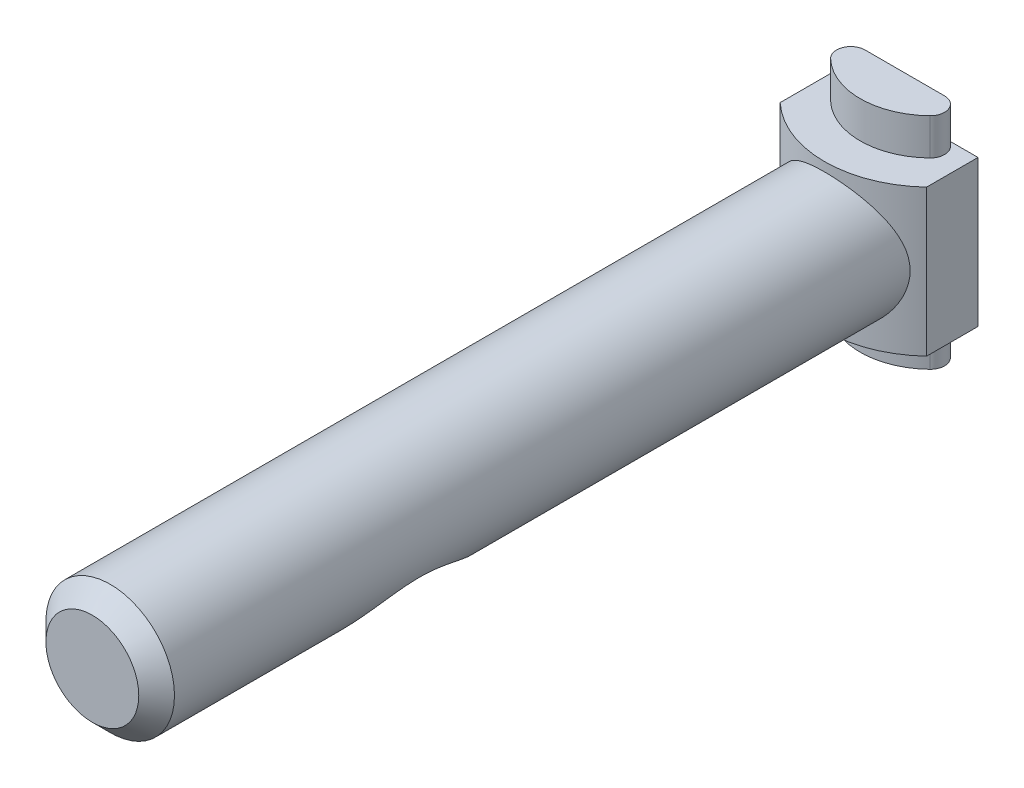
ISO-10303-21;
HEADER;
FILE_DESCRIPTION(('STEP AP214'),'2;1');
FILE_NAME('part.step','',(''),(''),'','','');
FILE_SCHEMA(('AUTOMOTIVE_DESIGN { 1 0 10303 214 1 1 1 1 }'));
ENDSEC;
DATA;
#1=APPLICATION_CONTEXT('core data for automotive mechanical design processes');
#2=APPLICATION_PROTOCOL_DEFINITION('international standard','automotive_design',2000,#1);
#3=PRODUCT_CONTEXT('',#1,'mechanical');
#4=PRODUCT('Part','Part','',(#3));
#5=PRODUCT_RELATED_PRODUCT_CATEGORY('part','',(#4));
#6=PRODUCT_DEFINITION_FORMATION('','',#4);
#7=PRODUCT_DEFINITION_CONTEXT('part definition',#1,'design');
#8=PRODUCT_DEFINITION('design','',#6,#7);
#9=PRODUCT_DEFINITION_SHAPE('','',#8);
#10=(LENGTH_UNIT() NAMED_UNIT(*) SI_UNIT(.MILLI.,.METRE.));
#11=(NAMED_UNIT(*) PLANE_ANGLE_UNIT() SI_UNIT($,.RADIAN.));
#12=(NAMED_UNIT(*) SI_UNIT($,.STERADIAN.) SOLID_ANGLE_UNIT());
#13=UNCERTAINTY_MEASURE_WITH_UNIT(LENGTH_MEASURE(1.E-05),#10,'distance_accuracy_value','');
#14=(GEOMETRIC_REPRESENTATION_CONTEXT(3) GLOBAL_UNCERTAINTY_ASSIGNED_CONTEXT((#13)) GLOBAL_UNIT_ASSIGNED_CONTEXT((#10,
#11,#12)) REPRESENTATION_CONTEXT('',''));
#15=CARTESIAN_POINT('',(0.,0.,0.));
#16=DIRECTION('',(0.,0.,1.));
#17=DIRECTION('',(1.,0.,0.));
#18=AXIS2_PLACEMENT_3D('',#15,#16,#17);
#19=CARTESIAN_POINT('',(1.7460457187E-05,6.14996560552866,-1.50009999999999));
#20=DIRECTION('',(0.,-1.,0.));
#21=DIRECTION('',(0.,0.,-1.));
#22=AXIS2_PLACEMENT_3D('',#19,#20,#21);
#23=PLANE('',#22);
#24=DIRECTION('',(1.,0.,0.));
#25=VECTOR('',#24,1.);
#26=CARTESIAN_POINT('',(1.7460457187E-05,6.14996560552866,1.1643711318E-05));
#27=LINE('',#26,#25);
#28=CARTESIAN_POINT('',(2.22476158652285,6.14996560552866,1.16437113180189E-05));
#29=VERTEX_POINT('',#28);
#30=CARTESIAN_POINT('',(-2.22472666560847,6.14996560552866,1.16437113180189E-05));
#31=VERTEX_POINT('',#30);
#32=EDGE_CURVE('E129',#29,#31,#27,.F.);
#33=ORIENTED_EDGE('',*,*,#32,.T.);
#34=CARTESIAN_POINT('',(-2.22472666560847,6.14996560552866,0.800011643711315));
#35=DIRECTION('',(0.,1.,0.));
#36=DIRECTION('',(0.,0.,1.));
#37=AXIS2_PLACEMENT_3D('',#34,#35,#36);
#38=CIRCLE('',#37,0.8);
#39=CARTESIAN_POINT('',(-2.78091269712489,6.14996560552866,1.37503955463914));
#40=VERTEX_POINT('',#39);
#41=EDGE_CURVE('E224',#40,#31,#38,.F.);
#42=ORIENTED_EDGE('',*,*,#41,.F.);
#43=CARTESIAN_POINT('',(1.7460457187E-05,6.14996560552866,-1.50009999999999));
#44=DIRECTION('',(0.,-1.,0.));
#45=DIRECTION('',(0.,0.,-1.));
#46=AXIS2_PLACEMENT_3D('',#43,#44,#45);
#47=CIRCLE('',#46,4.);
#48=CARTESIAN_POINT('',(2.78094761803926,6.14996560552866,1.37503955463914));
#49=VERTEX_POINT('',#48);
#50=EDGE_CURVE('E236',#49,#40,#47,.T.);
#51=ORIENTED_EDGE('',*,*,#50,.F.);
#52=CARTESIAN_POINT('',(2.22476158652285,6.14996560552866,0.800011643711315));
#53=DIRECTION('',(0.,1.,0.));
#54=DIRECTION('',(0.,0.,1.));
#55=AXIS2_PLACEMENT_3D('',#52,#53,#54);
#56=CIRCLE('',#55,0.8);
#57=EDGE_CURVE('E227',#29,#49,#56,.F.);
#58=ORIENTED_EDGE('',*,*,#57,.F.);
#59=EDGE_LOOP('',(#33,#42,#51,#58));
#60=FACE_BOUND('',#59,.T.);
#61=ADVANCED_FACE('F18',(#60),#23,.F.);
#62=CARTESIAN_POINT('',(1.7460457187E-05,-6.15003439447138,-1.50009999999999));
#63=DIRECTION('',(0.,-1.,0.));
#64=DIRECTION('',(0.,0.,-1.));
#65=AXIS2_PLACEMENT_3D('',#62,#63,#64);
#66=PLANE('',#65);
#67=CARTESIAN_POINT('',(-2.22472666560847,-6.15003439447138,0.800011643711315));
#68=DIRECTION('',(0.,-1.,0.));
#69=DIRECTION('',(0.,0.,-1.));
#70=AXIS2_PLACEMENT_3D('',#67,#68,#69);
#71=CIRCLE('',#70,0.8);
#72=CARTESIAN_POINT('',(-2.22472666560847,-6.15003439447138,1.16437113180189E-05));
#73=VERTEX_POINT('',#72);
#74=CARTESIAN_POINT('',(-2.78091269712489,-6.15003439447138,1.37503955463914));
#75=VERTEX_POINT('',#74);
#76=EDGE_CURVE('E21',#73,#75,#71,.F.);
#77=ORIENTED_EDGE('',*,*,#76,.F.);
#78=DIRECTION('',(1.,0.,0.));
#79=VECTOR('',#78,1.);
#80=CARTESIAN_POINT('',(1.7460457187E-05,-6.15003439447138,1.1643711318E-05));
#81=LINE('',#80,#79);
#82=CARTESIAN_POINT('',(2.22476158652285,-6.15003439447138,1.16437113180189E-05));
#83=VERTEX_POINT('',#82);
#84=EDGE_CURVE('E98',#73,#83,#81,.T.);
#85=ORIENTED_EDGE('',*,*,#84,.T.);
#86=CARTESIAN_POINT('',(2.22476158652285,-6.15003439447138,0.800011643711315));
#87=DIRECTION('',(0.,-1.,0.));
#88=DIRECTION('',(0.,0.,-1.));
#89=AXIS2_PLACEMENT_3D('',#86,#87,#88);
#90=CIRCLE('',#89,0.8);
#91=CARTESIAN_POINT('',(2.78094761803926,-6.15003439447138,1.37503955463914));
#92=VERTEX_POINT('',#91);
#93=EDGE_CURVE('E262',#92,#83,#90,.F.);
#94=ORIENTED_EDGE('',*,*,#93,.F.);
#95=CARTESIAN_POINT('',(1.7460457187E-05,-6.15003439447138,-1.50009999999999));
#96=DIRECTION('',(0.,-1.,0.));
#97=DIRECTION('',(0.,0.,-1.));
#98=AXIS2_PLACEMENT_3D('',#95,#96,#97);
#99=CIRCLE('',#98,4.);
#100=EDGE_CURVE('E101',#75,#92,#99,.F.);
#101=ORIENTED_EDGE('',*,*,#100,.F.);
#102=EDGE_LOOP('',(#77,#85,#94,#101));
#103=FACE_BOUND('',#102,.T.);
#104=ADVANCED_FACE('F96',(#103),#66,.T.);
#105=CARTESIAN_POINT('',(-2.22472666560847,-6.15003439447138,0.800011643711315));
#106=DIRECTION('',(0.,-1.,0.));
#107=DIRECTION('',(0.,0.,-1.));
#108=AXIS2_PLACEMENT_3D('',#105,#106,#107);
#109=CYLINDRICAL_SURFACE('',#108,0.8);
#110=CARTESIAN_POINT('',(-2.22472666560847,-4.1000343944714,0.800011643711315));
#111=DIRECTION('',(0.,-1.,0.));
#112=DIRECTION('',(0.,0.,-1.));
#113=AXIS2_PLACEMENT_3D('',#110,#111,#112);
#114=CIRCLE('',#113,0.8);
#115=CARTESIAN_POINT('',(-2.22472666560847,-4.1000343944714,1.16437112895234E-05));
#116=VERTEX_POINT('',#115);
#117=CARTESIAN_POINT('',(-2.78091269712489,-4.1000343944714,1.37503955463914));
#118=VERTEX_POINT('',#117);
#119=EDGE_CURVE('E110',#116,#118,#114,.F.);
#120=ORIENTED_EDGE('',*,*,#119,.F.);
#121=DIRECTION('',(0.,1.,0.));
#122=VECTOR('',#121,1.);
#123=CARTESIAN_POINT('',(-2.22472666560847,-3.4394471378E-05,1.1643711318E-05));
#124=LINE('',#123,#122);
#125=EDGE_CURVE('E107',#116,#73,#124,.F.);
#126=ORIENTED_EDGE('',*,*,#125,.T.);
#127=ORIENTED_EDGE('',*,*,#76,.T.);
#128=DIRECTION('',(0.,-1.,0.));
#129=VECTOR('',#128,1.);
#130=CARTESIAN_POINT('',(-2.78091269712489,-6.15003439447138,1.37503955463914));
#131=LINE('',#130,#129);
#132=EDGE_CURVE('E105',#118,#75,#131,.T.);
#133=ORIENTED_EDGE('',*,*,#132,.F.);
#134=EDGE_LOOP('',(#120,#126,#127,#133));
#135=FACE_BOUND('',#134,.T.);
#136=ADVANCED_FACE('F108',(#135),#109,.T.);
#137=CARTESIAN_POINT('',(1.7460457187E-05,-6.15003439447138,-1.50009999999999));
#138=DIRECTION('',(0.,-1.,0.));
#139=DIRECTION('',(0.,0.,-1.));
#140=AXIS2_PLACEMENT_3D('',#137,#138,#139);
#141=CYLINDRICAL_SURFACE('',#140,4.);
#142=ORIENTED_EDGE('',*,*,#132,.T.);
#143=ORIENTED_EDGE('',*,*,#100,.T.);
#144=DIRECTION('',(0.,-1.,0.));
#145=VECTOR('',#144,1.);
#146=CARTESIAN_POINT('',(2.78094761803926,-6.15003439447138,1.37503955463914));
#147=LINE('',#146,#145);
#148=CARTESIAN_POINT('',(2.78094761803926,-4.1000343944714,1.37503955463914));
#149=VERTEX_POINT('',#148);
#150=EDGE_CURVE('E237',#149,#92,#147,.T.);
#151=ORIENTED_EDGE('',*,*,#150,.F.);
#152=CARTESIAN_POINT('',(1.7460457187E-05,-4.1000343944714,-1.50009999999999));
#153=DIRECTION('',(0.,-1.,0.));
#154=DIRECTION('',(0.,0.,-1.));
#155=AXIS2_PLACEMENT_3D('',#152,#153,#154);
#156=CIRCLE('',#155,4.);
#157=EDGE_CURVE('E272',#118,#149,#156,.F.);
#158=ORIENTED_EDGE('',*,*,#157,.F.);
#159=EDGE_LOOP('',(#142,#143,#151,#158));
#160=FACE_BOUND('',#159,.T.);
#161=ADVANCED_FACE('F208',(#160),#141,.T.);
#162=CARTESIAN_POINT('',(2.22476158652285,-6.15003439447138,0.800011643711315));
#163=DIRECTION('',(0.,-1.,0.));
#164=DIRECTION('',(0.,0.,-1.));
#165=AXIS2_PLACEMENT_3D('',#162,#163,#164);
#166=CYLINDRICAL_SURFACE('',#165,0.8);
#167=CARTESIAN_POINT('',(2.22476158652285,-4.1000343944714,0.800011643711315));
#168=DIRECTION('',(0.,-1.,0.));
#169=DIRECTION('',(0.,0.,-1.));
#170=AXIS2_PLACEMENT_3D('',#167,#168,#169);
#171=CIRCLE('',#170,0.8);
#172=CARTESIAN_POINT('',(2.22476158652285,-4.1000343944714,1.16437113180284E-05));
#173=VERTEX_POINT('',#172);
#174=EDGE_CURVE('E277',#149,#173,#171,.F.);
#175=ORIENTED_EDGE('',*,*,#174,.F.);
#176=ORIENTED_EDGE('',*,*,#150,.T.);
#177=ORIENTED_EDGE('',*,*,#93,.T.);
#178=DIRECTION('',(0.,1.,0.));
#179=VECTOR('',#178,1.);
#180=CARTESIAN_POINT('',(2.22476158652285,-3.4394471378E-05,1.1643711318E-05));
#181=LINE('',#180,#179);
#182=EDGE_CURVE('E121',#83,#173,#181,.T.);
#183=ORIENTED_EDGE('',*,*,#182,.T.);
#184=EDGE_LOOP('',(#175,#176,#177,#183));
#185=FACE_BOUND('',#184,.T.);
#186=ADVANCED_FACE('F204',(#185),#166,.T.);
#187=CARTESIAN_POINT('',(-2.22472666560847,-6.15003439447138,0.800011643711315));
#188=DIRECTION('',(0.,1.,0.));
#189=DIRECTION('',(0.,0.,1.));
#190=AXIS2_PLACEMENT_3D('',#187,#188,#189);
#191=CYLINDRICAL_SURFACE('',#190,0.8);
#192=CARTESIAN_POINT('',(-2.22472666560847,4.09996560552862,0.800011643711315));
#193=DIRECTION('',(0.,1.,0.));
#194=DIRECTION('',(0.,0.,1.));
#195=AXIS2_PLACEMENT_3D('',#192,#193,#194);
#196=CIRCLE('',#195,0.8);
#197=CARTESIAN_POINT('',(-2.22472666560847,4.09996560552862,1.16437112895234E-05));
#198=VERTEX_POINT('',#197);
#199=CARTESIAN_POINT('',(-2.78091269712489,4.09996560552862,1.37503955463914));
#200=VERTEX_POINT('',#199);
#201=EDGE_CURVE('E254',#198,#200,#196,.T.);
#202=ORIENTED_EDGE('',*,*,#201,.T.);
#203=DIRECTION('',(0.,-1.,0.));
#204=VECTOR('',#203,1.);
#205=CARTESIAN_POINT('',(-2.78091269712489,-6.15003439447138,1.37503955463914));
#206=LINE('',#205,#204);
#207=EDGE_CURVE('E234',#40,#200,#206,.T.);
#208=ORIENTED_EDGE('',*,*,#207,.F.);
#209=ORIENTED_EDGE('',*,*,#41,.T.);
#210=DIRECTION('',(0.,1.,0.));
#211=VECTOR('',#210,1.);
#212=CARTESIAN_POINT('',(-2.22472666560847,-3.4394471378E-05,1.1643711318E-05));
#213=LINE('',#212,#211);
#214=EDGE_CURVE('E115',#31,#198,#213,.F.);
#215=ORIENTED_EDGE('',*,*,#214,.T.);
#216=EDGE_LOOP('',(#202,#208,#209,#215));
#217=FACE_BOUND('',#216,.T.);
#218=ADVANCED_FACE('F200',(#217),#191,.T.);
#219=CARTESIAN_POINT('',(1.7460457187E-05,-6.15003439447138,-1.50009999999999));
#220=DIRECTION('',(0.,-1.,0.));
#221=DIRECTION('',(0.,0.,-1.));
#222=AXIS2_PLACEMENT_3D('',#219,#220,#221);
#223=CYLINDRICAL_SURFACE('',#222,4.);
#224=ORIENTED_EDGE('',*,*,#207,.T.);
#225=CARTESIAN_POINT('',(1.7460457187E-05,4.09996560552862,-1.50009999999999));
#226=DIRECTION('',(0.,-1.,0.));
#227=DIRECTION('',(0.,0.,-1.));
#228=AXIS2_PLACEMENT_3D('',#225,#226,#227);
#229=CIRCLE('',#228,4.);
#230=CARTESIAN_POINT('',(2.78094761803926,4.09996560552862,1.37503955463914));
#231=VERTEX_POINT('',#230);
#232=EDGE_CURVE('E281',#200,#231,#229,.F.);
#233=ORIENTED_EDGE('',*,*,#232,.T.);
#234=DIRECTION('',(0.,1.,0.));
#235=VECTOR('',#234,1.);
#236=CARTESIAN_POINT('',(2.78094761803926,-6.15003439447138,1.37503955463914));
#237=LINE('',#236,#235);
#238=EDGE_CURVE('E231',#49,#231,#237,.F.);
#239=ORIENTED_EDGE('',*,*,#238,.F.);
#240=ORIENTED_EDGE('',*,*,#50,.T.);
#241=EDGE_LOOP('',(#224,#233,#239,#240));
#242=FACE_BOUND('',#241,.T.);
#243=ADVANCED_FACE('F196',(#242),#223,.T.);
#244=CARTESIAN_POINT('',(2.22476158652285,-6.15003439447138,0.800011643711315));
#245=DIRECTION('',(0.,1.,0.));
#246=DIRECTION('',(0.,0.,1.));
#247=AXIS2_PLACEMENT_3D('',#244,#245,#246);
#248=CYLINDRICAL_SURFACE('',#247,0.8);
#249=CARTESIAN_POINT('',(2.22476158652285,4.09996560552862,0.800011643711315));
#250=DIRECTION('',(0.,1.,0.));
#251=DIRECTION('',(0.,0.,1.));
#252=AXIS2_PLACEMENT_3D('',#249,#250,#251);
#253=CIRCLE('',#252,0.8);
#254=CARTESIAN_POINT('',(2.22476158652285,4.09996560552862,1.16437113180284E-05));
#255=VERTEX_POINT('',#254);
#256=EDGE_CURVE('E283',#231,#255,#253,.T.);
#257=ORIENTED_EDGE('',*,*,#256,.T.);
#258=DIRECTION('',(0.,1.,0.));
#259=VECTOR('',#258,1.);
#260=CARTESIAN_POINT('',(2.22476158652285,-3.4394471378E-05,1.1643711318E-05));
#261=LINE('',#260,#259);
#262=EDGE_CURVE('E126',#255,#29,#261,.T.);
#263=ORIENTED_EDGE('',*,*,#262,.T.);
#264=ORIENTED_EDGE('',*,*,#57,.T.);
#265=ORIENTED_EDGE('',*,*,#238,.T.);
#266=EDGE_LOOP('',(#257,#263,#264,#265));
#267=FACE_BOUND('',#266,.T.);
#268=ADVANCED_FACE('F193',(#267),#248,.T.);
#269=CARTESIAN_POINT('',(1.7460457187E-05,-3.4394471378E-05,1.1643711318E-05));
#270=DIRECTION('',(0.,0.,1.));
#271=DIRECTION('',(1.,0.,0.));
#272=AXIS2_PLACEMENT_3D('',#269,#270,#271);
#273=PLANE('',#272);
#274=DIRECTION('',(1.,0.,0.));
#275=VECTOR('',#274,1.);
#276=CARTESIAN_POINT('',(0.100017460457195,4.09996560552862,1.16437113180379E-05));
#277=LINE('',#276,#275);
#278=CARTESIAN_POINT('',(4.10001746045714,4.09996560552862,1.16437113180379E-05));
#279=VERTEX_POINT('',#278);
#280=EDGE_CURVE('E285',#255,#279,#277,.T.);
#281=ORIENTED_EDGE('',*,*,#280,.T.);
#282=DIRECTION('',(0.,1.,0.));
#283=VECTOR('',#282,1.);
#284=CARTESIAN_POINT('',(4.10001746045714,-3.4394471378E-05,1.16437113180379E-05));
#285=LINE('',#284,#283);
#286=CARTESIAN_POINT('',(4.10001746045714,-4.1000343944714,1.16437113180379E-05));
#287=VERTEX_POINT('',#286);
#288=EDGE_CURVE('E251',#279,#287,#285,.F.);
#289=ORIENTED_EDGE('',*,*,#288,.T.);
#290=DIRECTION('',(1.,0.,0.));
#291=VECTOR('',#290,1.);
#292=CARTESIAN_POINT('',(-0.099982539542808,-4.1000343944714,1.16437113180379E-05));
#293=LINE('',#292,#291);
#294=EDGE_CURVE('E246',#173,#287,#293,.T.);
#295=ORIENTED_EDGE('',*,*,#294,.F.);
#296=ORIENTED_EDGE('',*,*,#182,.F.);
#297=ORIENTED_EDGE('',*,*,#84,.F.);
#298=ORIENTED_EDGE('',*,*,#125,.F.);
#299=DIRECTION('',(1.,0.,0.));
#300=VECTOR('',#299,1.);
#301=CARTESIAN_POINT('',(-0.099982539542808,-4.1000343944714,1.16437112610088E-05));
#302=LINE('',#301,#300);
#303=CARTESIAN_POINT('',(-4.09998253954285,-4.1000343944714,1.16437112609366E-05));
#304=VERTEX_POINT('',#303);
#305=EDGE_CURVE('E273',#304,#116,#302,.T.);
#306=ORIENTED_EDGE('',*,*,#305,.F.);
#307=DIRECTION('',(0.,1.,0.));
#308=VECTOR('',#307,1.);
#309=CARTESIAN_POINT('',(-4.09998253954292,-3.4394471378E-05,1.1643711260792E-05));
#310=LINE('',#309,#308);
#311=CARTESIAN_POINT('',(-4.09998253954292,4.09996560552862,1.16437112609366E-05));
#312=VERTEX_POINT('',#311);
#313=EDGE_CURVE('E248',#304,#312,#310,.T.);
#314=ORIENTED_EDGE('',*,*,#313,.T.);
#315=DIRECTION('',(1.,0.,0.));
#316=VECTOR('',#315,1.);
#317=CARTESIAN_POINT('',(0.100017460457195,4.09996560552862,1.16437112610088E-05));
#318=LINE('',#317,#316);
#319=EDGE_CURVE('E241',#312,#198,#318,.T.);
#320=ORIENTED_EDGE('',*,*,#319,.T.);
#321=ORIENTED_EDGE('',*,*,#214,.F.);
#322=ORIENTED_EDGE('',*,*,#32,.F.);
#323=ORIENTED_EDGE('',*,*,#262,.F.);
#324=EDGE_LOOP('',(#281,#289,#295,#296,#297,#298,#306,#314,#320,#321,#322,#323));
#325=FACE_BOUND('',#324,.T.);
#326=ADVANCED_FACE('F119',(#325),#273,.F.);
#327=CARTESIAN_POINT('',(1.7460457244E-05,-3.4394471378E-05,45.4999));
#328=DIRECTION('',(0.,0.,-1.));
#329=DIRECTION('',(-1.,0.,0.));
#330=AXIS2_PLACEMENT_3D('',#327,#328,#329);
#331=PLANE('',#330);
#332=CARTESIAN_POINT('',(1.74604572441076E-05,-3.4394471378E-05,45.4999000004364));
#333=DIRECTION('',(0.,0.,-1.));
#334=DIRECTION('',(-1.,0.,0.));
#335=AXIS2_PLACEMENT_3D('',#332,#333,#334);
#336=CIRCLE('',#335,2.60000000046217);
#337=CARTESIAN_POINT('',(2.60001746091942,-3.43944713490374E-05,45.4999000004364));
#338=VERTEX_POINT('',#337);
#339=EDGE_CURVE('E34',#338,#338,#336,.T.);
#340=ORIENTED_EDGE('',*,*,#339,.F.);
#341=EDGE_LOOP('',(#340));
#342=FACE_BOUND('',#341,.T.);
#343=ADVANCED_FACE('F187',(#342),#331,.F.);
#344=CARTESIAN_POINT('',(-4.09998253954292,-3.4394471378E-05,1.99995582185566));
#345=DIRECTION('',(1.,0.,0.));
#346=DIRECTION('',(0.,0.,-1.));
#347=AXIS2_PLACEMENT_3D('',#344,#345,#346);
#348=PLANE('',#347);
#349=ORIENTED_EDGE('',*,*,#313,.F.);
#350=DIRECTION('',(0.,0.,-1.));
#351=VECTOR('',#350,1.);
#352=CARTESIAN_POINT('',(-4.09998253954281,-4.1000343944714,-1.50009999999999));
#353=LINE('',#352,#351);
#354=CARTESIAN_POINT('',(-4.09998253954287,-4.1000343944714,2.88053922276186));
#355=VERTEX_POINT('',#354);
#356=EDGE_CURVE('E314',#355,#304,#353,.T.);
#357=ORIENTED_EDGE('',*,*,#356,.F.);
#358=DIRECTION('',(0.,-1.,0.));
#359=VECTOR('',#358,1.);
#360=CARTESIAN_POINT('',(-4.09998253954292,-4.1000343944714,2.88053922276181));
#361=LINE('',#360,#359);
#362=CARTESIAN_POINT('',(-4.09998253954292,4.09996560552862,2.88053922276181));
#363=VERTEX_POINT('',#362);
#364=EDGE_CURVE('E288',#363,#355,#361,.T.);
#365=ORIENTED_EDGE('',*,*,#364,.F.);
#366=DIRECTION('',(0.,0.,-1.));
#367=VECTOR('',#366,1.);
#368=CARTESIAN_POINT('',(-4.09998253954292,4.09996560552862,-1.50009999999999));
#369=LINE('',#368,#367);
#370=EDGE_CURVE('E481',#363,#312,#369,.T.);
#371=ORIENTED_EDGE('',*,*,#370,.T.);
#372=EDGE_LOOP('',(#349,#357,#365,#371));
#373=FACE_BOUND('',#372,.T.);
#374=ADVANCED_FACE('F183',(#373),#348,.F.);
#375=CARTESIAN_POINT('',(-0.099982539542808,-4.1000343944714,-1.50009999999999));
#376=DIRECTION('',(0.,-1.,0.));
#377=DIRECTION('',(0.,0.,-1.));
#378=AXIS2_PLACEMENT_3D('',#375,#376,#377);
#379=PLANE('',#378);
#380=ORIENTED_EDGE('',*,*,#157,.T.);
#381=ORIENTED_EDGE('',*,*,#174,.T.);
#382=ORIENTED_EDGE('',*,*,#294,.T.);
#383=DIRECTION('',(0.,0.,1.));
#384=VECTOR('',#383,1.);
#385=CARTESIAN_POINT('',(4.10001746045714,-4.1000343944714,2.49995582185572));
#386=LINE('',#385,#384);
#387=CARTESIAN_POINT('',(4.10001746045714,-4.1000343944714,2.88053922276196));
#388=VERTEX_POINT('',#387);
#389=EDGE_CURVE('E255',#287,#388,#386,.T.);
#390=ORIENTED_EDGE('',*,*,#389,.T.);
#391=CARTESIAN_POINT('',(1.7460457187E-05,-4.1000343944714,-1.50009999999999));
#392=DIRECTION('',(0.,-1.,0.));
#393=DIRECTION('',(0.,0.,-1.));
#394=AXIS2_PLACEMENT_3D('',#391,#392,#393);
#395=CIRCLE('',#394,6.);
#396=EDGE_CURVE('E289',#355,#388,#395,.F.);
#397=ORIENTED_EDGE('',*,*,#396,.F.);
#398=ORIENTED_EDGE('',*,*,#356,.T.);
#399=ORIENTED_EDGE('',*,*,#305,.T.);
#400=ORIENTED_EDGE('',*,*,#119,.T.);
#401=EDGE_LOOP('',(#380,#381,#382,#390,#397,#398,#399,#400));
#402=FACE_BOUND('',#401,.T.);
#403=ADVANCED_FACE('F179',(#402),#379,.T.);
#404=CARTESIAN_POINT('',(4.10001746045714,-3.4394471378E-05,2.49995582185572));
#405=DIRECTION('',(-1.,0.,0.));
#406=DIRECTION('',(0.,0.,1.));
#407=AXIS2_PLACEMENT_3D('',#404,#405,#406);
#408=PLANE('',#407);
#409=DIRECTION('',(0.,0.,-1.));
#410=VECTOR('',#409,1.);
#411=CARTESIAN_POINT('',(4.10001746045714,4.09996560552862,-1.50009999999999));
#412=LINE('',#411,#410);
#413=CARTESIAN_POINT('',(4.10001746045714,4.09996560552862,2.88053922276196));
#414=VERTEX_POINT('',#413);
#415=EDGE_CURVE('E327',#279,#414,#412,.F.);
#416=ORIENTED_EDGE('',*,*,#415,.T.);
#417=DIRECTION('',(0.,-1.,0.));
#418=VECTOR('',#417,1.);
#419=CARTESIAN_POINT('',(4.10001746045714,-4.1000343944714,2.88053922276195));
#420=LINE('',#419,#418);
#421=EDGE_CURVE('E291',#388,#414,#420,.F.);
#422=ORIENTED_EDGE('',*,*,#421,.F.);
#423=ORIENTED_EDGE('',*,*,#389,.F.);
#424=ORIENTED_EDGE('',*,*,#288,.F.);
#425=EDGE_LOOP('',(#416,#422,#423,#424));
#426=FACE_BOUND('',#425,.T.);
#427=ADVANCED_FACE('F175',(#426),#408,.F.);
#428=CARTESIAN_POINT('',(0.100017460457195,4.09996560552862,-1.50009999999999));
#429=DIRECTION('',(0.,-1.,0.));
#430=DIRECTION('',(0.,0.,-1.));
#431=AXIS2_PLACEMENT_3D('',#428,#429,#430);
#432=PLANE('',#431);
#433=ORIENTED_EDGE('',*,*,#370,.F.);
#434=CARTESIAN_POINT('',(1.7460457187E-05,4.09996560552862,-1.50009999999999));
#435=DIRECTION('',(0.,-1.,0.));
#436=DIRECTION('',(0.,0.,-1.));
#437=AXIS2_PLACEMENT_3D('',#434,#435,#436);
#438=CIRCLE('',#437,6.);
#439=EDGE_CURVE('E292',#414,#363,#438,.T.);
#440=ORIENTED_EDGE('',*,*,#439,.F.);
#441=ORIENTED_EDGE('',*,*,#415,.F.);
#442=ORIENTED_EDGE('',*,*,#280,.F.);
#443=ORIENTED_EDGE('',*,*,#256,.F.);
#444=ORIENTED_EDGE('',*,*,#232,.F.);
#445=ORIENTED_EDGE('',*,*,#201,.F.);
#446=ORIENTED_EDGE('',*,*,#319,.F.);
#447=EDGE_LOOP('',(#433,#440,#441,#442,#443,#444,#445,#446));
#448=FACE_BOUND('',#447,.T.);
#449=ADVANCED_FACE('F171',(#448),#432,.F.);
#450=CARTESIAN_POINT('',(1.74604572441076E-05,-3.4394471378E-05,44.4998999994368));
#451=DIRECTION('',(0.,0.,-1.));
#452=DIRECTION('',(-1.,0.,0.));
#453=AXIS2_PLACEMENT_3D('',#450,#451,#452);
#454=CONICAL_SURFACE('',#453,3.59999999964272,0.785398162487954);
#455=ORIENTED_EDGE('',*,*,#339,.T.);
#456=EDGE_LOOP('',(#455));
#457=FACE_BOUND('',#456,.T.);
#458=CARTESIAN_POINT('',(1.7460457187E-05,-3.4394471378E-05,44.4999));
#459=DIRECTION('',(0.,0.,-1.));
#460=DIRECTION('',(-1.,0.,0.));
#461=AXIS2_PLACEMENT_3D('',#458,#459,#460);
#462=CIRCLE('',#461,3.6);
#463=CARTESIAN_POINT('',(3.60001746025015,-3.43944713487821E-05,44.4998999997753));
#464=VERTEX_POINT('',#463);
#465=EDGE_CURVE('E294',#464,#464,#462,.T.);
#466=ORIENTED_EDGE('',*,*,#465,.F.);
#467=EDGE_LOOP('',(#466));
#468=FACE_BOUND('',#467,.T.);
#469=ADVANCED_FACE('F166',(#457,#468),#454,.T.);
#470=CARTESIAN_POINT('',(1.7460457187E-05,-4.1000343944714,-1.50009999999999));
#471=DIRECTION('',(0.,-1.,0.));
#472=DIRECTION('',(0.,0.,-1.));
#473=AXIS2_PLACEMENT_3D('',#470,#471,#472);
#474=CYLINDRICAL_SURFACE('',#473,6.);
#475=CARTESIAN_POINT('',(-3.59998253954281,-3.43944713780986E-05,3.29990000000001));
#476=CARTESIAN_POINT('',(-3.60000286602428,-0.091080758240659,3.29986144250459));
#477=CARTESIAN_POINT('',(-3.59652944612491,-0.182104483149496,3.30248943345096));
#478=CARTESIAN_POINT('',(-3.5827567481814,-0.363260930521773,3.31278498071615));
#479=CARTESIAN_POINT('',(-3.57246412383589,-0.453394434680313,3.32044762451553));
#480=CARTESIAN_POINT('',(-3.54532311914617,-0.631389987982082,3.34043968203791));
#481=CARTESIAN_POINT('',(-3.5285278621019,-0.719264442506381,3.35273125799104));
#482=CARTESIAN_POINT('',(-3.48864812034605,-0.892868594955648,3.38147941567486));
#483=CARTESIAN_POINT('',(-3.46556237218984,-0.978597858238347,3.39793683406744));
#484=CARTESIAN_POINT('',(-3.38750069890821,-1.23114978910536,3.4525512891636));
#485=CARTESIAN_POINT('',(-3.32359313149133,-1.39414647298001,3.49605056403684));
#486=CARTESIAN_POINT('',(-3.17421474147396,-1.70721874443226,3.59225967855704));
#487=CARTESIAN_POINT('',(-3.08869497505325,-1.85726395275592,3.64499033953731));
#488=CARTESIAN_POINT('',(-2.88648098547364,-2.15992914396,3.76139568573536));
#489=CARTESIAN_POINT('',(-2.76726281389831,-2.31065113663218,3.82562187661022));
#490=CARTESIAN_POINT('',(-2.50614275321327,-2.59154223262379,3.9533629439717));
#491=CARTESIAN_POINT('',(-2.36423274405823,-2.72170394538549,4.01687755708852));
#492=CARTESIAN_POINT('',(-2.12773740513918,-2.9059087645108,4.11068715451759));
#493=CARTESIAN_POINT('',(-2.04021183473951,-2.96804056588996,4.14318222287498));
#494=CARTESIAN_POINT('',(-1.85926013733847,-3.0846182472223,4.20535541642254));
#495=CARTESIAN_POINT('',(-1.76583666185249,-3.13906754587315,4.23503479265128));
#496=CARTESIAN_POINT('',(-1.57363502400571,-3.23969198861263,4.29072267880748));
#497=CARTESIAN_POINT('',(-1.47485888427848,-3.28587023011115,4.31673256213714));
#498=CARTESIAN_POINT('',(-1.27259990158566,-3.36936785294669,4.36430360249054));
#499=CARTESIAN_POINT('',(-1.16911783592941,-3.4066886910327,4.38586549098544));
#500=CARTESIAN_POINT('',(-0.968365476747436,-3.4687801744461,4.42203001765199));
#501=CARTESIAN_POINT('',(-0.871444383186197,-3.49440844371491,4.43710032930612));
#502=CARTESIAN_POINT('',(-0.675222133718,-3.53756724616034,4.46260364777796));
#503=CARTESIAN_POINT('',(-0.575921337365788,-3.5550989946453,4.47303735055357));
#504=CARTESIAN_POINT('',(-0.375879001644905,-3.58177647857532,4.48895348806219));
#505=CARTESIAN_POINT('',(-0.275138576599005,-3.59092837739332,4.49443956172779));
#506=CARTESIAN_POINT('',(-0.0731019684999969,-3.60071215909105,4.50030538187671));
#507=CARTESIAN_POINT('',(0.0281941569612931,-3.60134490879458,4.50068564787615));
#508=CARTESIAN_POINT('',(0.217787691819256,-3.59453297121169,4.49660026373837));
#509=CARTESIAN_POINT('',(0.306135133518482,-3.58808294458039,4.49273133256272));
#510=CARTESIAN_POINT('',(0.481877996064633,-3.56873722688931,4.48116948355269));
#511=CARTESIAN_POINT('',(0.569273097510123,-3.55583943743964,4.47347532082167));
#512=CARTESIAN_POINT('',(0.829033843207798,-3.50769147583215,4.44489387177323));
#513=CARTESIAN_POINT('',(0.999154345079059,-3.46297987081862,4.41850326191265));
#514=CARTESIAN_POINT('',(1.32978280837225,-3.35003367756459,4.35313671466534));
#515=CARTESIAN_POINT('',(1.49022906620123,-3.28166370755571,4.31408842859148));
#516=CARTESIAN_POINT('',(1.79758702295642,-3.12391013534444,4.22653021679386));
#517=CARTESIAN_POINT('',(1.94449558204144,-3.03452167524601,4.17801810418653));
#518=CARTESIAN_POINT('',(2.23937924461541,-2.8252313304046,4.06881687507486));
#519=CARTESIAN_POINT('',(2.38539008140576,-2.70296124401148,4.00736547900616));
#520=CARTESIAN_POINT('',(2.65609571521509,-2.4375134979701,3.88205220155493));
#521=CARTESIAN_POINT('',(2.78075561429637,-2.29430230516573,3.81818657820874));
#522=CARTESIAN_POINT('',(3.01993737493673,-1.97107281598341,3.68649722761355));
#523=CARTESIAN_POINT('',(3.13157945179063,-1.78870959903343,3.61908107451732));
#524=CARTESIAN_POINT('',(3.27426046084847,-1.50030901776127,3.52807380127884));
#525=CARTESIAN_POINT('',(3.31766042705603,-1.40180189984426,3.49944700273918));
#526=CARTESIAN_POINT('',(3.3957661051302,-1.20026095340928,3.44672786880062));
#527=CARTESIAN_POINT('',(3.43047894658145,-1.09723091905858,3.42263181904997));
#528=CARTESIAN_POINT('',(3.48330580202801,-0.91300448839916,3.38533535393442));
#529=CARTESIAN_POINT('',(3.5034032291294,-0.832617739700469,3.37091107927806));
#530=CARTESIAN_POINT('',(3.53808235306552,-0.670106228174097,3.34578001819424));
#531=CARTESIAN_POINT('',(3.55266586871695,-0.587982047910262,3.33507200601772));
#532=CARTESIAN_POINT('',(3.57619961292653,-0.421925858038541,3.31769515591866));
#533=CARTESIAN_POINT('',(3.58511083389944,-0.337985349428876,3.31105429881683));
#534=CARTESIAN_POINT('',(3.59703032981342,-0.169380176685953,3.30213999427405));
#535=CARTESIAN_POINT('',(3.60003315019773,-0.0847149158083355,3.29987058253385));
#536=CARTESIAN_POINT('',(3.60001746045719,-3.43944713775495E-05,3.29990000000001));
#537=B_SPLINE_CURVE_WITH_KNOTS('',3,(#475,#476,#477,#478,#479,#480,#481,#482,#483,#484,#485,
#486,#487,#488,#489,#490,#491,#492,#493,#494,#495,#496,#497,#498,#499,#500,#501,#502,#503,#504,
#505,#506,#507,#508,#509,#510,#511,#512,#513,#514,#515,#516,#517,#518,#519,#520,#521,#522,#523,
#524,#525,#526,#527,#528,#529,#530,#531,#532,#533,#534,#535,#536),.UNSPECIFIED.,.F.,.F.,(4,2,2,
2,2,2,2,2,2,2,2,2,2,2,2,2,2,2,2,2,2,2,2,2,2,2,2,2,2,2,4),(0.,0.27299826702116,0.545730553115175,
0.816280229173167,1.08688428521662,1.62564619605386,2.16563931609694,2.77117496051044,
3.37692777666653,3.71298632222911,4.0488948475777,4.38467731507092,4.72040451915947,
5.02410344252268,5.32775676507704,5.63118657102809,5.93458550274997,6.20025618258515,
6.46601337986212,6.99699588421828,7.53106853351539,8.06526474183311,8.6632004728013,
9.26210438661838,9.93088430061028,10.2646296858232,10.598100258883,10.8501681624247,
11.1021528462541,11.3558521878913,11.6097856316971),.UNSPECIFIED.);
#538=CARTESIAN_POINT('',(-3.59998253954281,-3.43944713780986E-05,3.29990000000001));
#539=VERTEX_POINT('',#538);
#540=CARTESIAN_POINT('',(3.60001746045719,-3.43944713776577E-05,3.29990000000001));
#541=VERTEX_POINT('',#540);
#542=EDGE_CURVE('E151',#539,#541,#537,.T.);
#543=ORIENTED_EDGE('',*,*,#542,.F.);
#544=CARTESIAN_POINT('',(3.60001746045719,-3.43944713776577E-05,3.29990000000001));
#545=CARTESIAN_POINT('',(3.60003778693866,0.0910119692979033,3.29986144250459));
#546=CARTESIAN_POINT('',(3.59656436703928,0.18203569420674,3.30248943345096));
#547=CARTESIAN_POINT('',(3.58279166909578,0.363192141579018,3.31278498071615));
#548=CARTESIAN_POINT('',(3.57249904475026,0.453325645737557,3.32044762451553));
#549=CARTESIAN_POINT('',(3.54535804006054,0.631321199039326,3.34043968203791));
#550=CARTESIAN_POINT('',(3.52856278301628,0.719195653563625,3.35273125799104));
#551=CARTESIAN_POINT('',(3.48868304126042,0.892799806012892,3.38147941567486));
#552=CARTESIAN_POINT('',(3.46559729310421,0.978529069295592,3.39793683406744));
#553=CARTESIAN_POINT('',(3.38753561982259,1.23108100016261,3.4525512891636));
#554=CARTESIAN_POINT('',(3.3236280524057,1.39407768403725,3.49605056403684));
#555=CARTESIAN_POINT('',(3.17424966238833,1.7071499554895,3.59225967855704));
#556=CARTESIAN_POINT('',(3.08872989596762,1.85719516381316,3.64499033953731));
#557=CARTESIAN_POINT('',(2.88651590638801,2.15986035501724,3.76139568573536));
#558=CARTESIAN_POINT('',(2.76729773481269,2.31058234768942,3.82562187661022));
#559=CARTESIAN_POINT('',(2.50617767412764,2.59147344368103,3.9533629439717));
#560=CARTESIAN_POINT('',(2.3642676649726,2.72163515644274,4.01687755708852));
#561=CARTESIAN_POINT('',(2.12777232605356,2.90583997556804,4.11068715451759));
#562=CARTESIAN_POINT('',(2.04024675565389,2.9679717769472,4.14318222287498));
#563=CARTESIAN_POINT('',(1.85929505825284,3.08454945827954,4.20535541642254));
#564=CARTESIAN_POINT('',(1.76587158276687,3.13899875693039,4.23503479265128));
#565=CARTESIAN_POINT('',(1.57366994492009,3.23962319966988,4.29072267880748));
#566=CARTESIAN_POINT('',(1.47489380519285,3.28580144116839,4.31673256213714));
#567=CARTESIAN_POINT('',(1.27263482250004,3.36929906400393,4.36430360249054));
#568=CARTESIAN_POINT('',(1.16915275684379,3.40661990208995,4.38586549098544));
#569=CARTESIAN_POINT('',(0.96840039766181,3.46871138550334,4.42203001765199));
#570=CARTESIAN_POINT('',(0.871479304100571,3.49433965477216,4.43710032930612));
#571=CARTESIAN_POINT('',(0.675257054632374,3.53749845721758,4.46260364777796));
#572=CARTESIAN_POINT('',(0.575956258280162,3.55503020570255,4.47303735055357));
#573=CARTESIAN_POINT('',(0.375913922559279,3.58170768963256,4.48895348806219));
#574=CARTESIAN_POINT('',(0.275173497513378,3.59085958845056,4.49443956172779));
#575=CARTESIAN_POINT('',(0.0731368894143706,3.6006433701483,4.50030538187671));
#576=CARTESIAN_POINT('',(-0.0281592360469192,3.60127611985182,4.50068564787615));
#577=CARTESIAN_POINT('',(-0.217752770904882,3.59446418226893,4.49660026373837));
#578=CARTESIAN_POINT('',(-0.306100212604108,3.58801415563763,4.49273133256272));
#579=CARTESIAN_POINT('',(-0.481843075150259,3.56866843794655,4.48116948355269));
#580=CARTESIAN_POINT('',(-0.569238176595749,3.55577064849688,4.47347532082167));
#581=CARTESIAN_POINT('',(-0.828998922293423,3.50762268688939,4.44489387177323));
#582=CARTESIAN_POINT('',(-0.999119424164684,3.46291108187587,4.41850326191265));
#583=CARTESIAN_POINT('',(-1.32974788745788,3.34996488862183,4.35313671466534));
#584=CARTESIAN_POINT('',(-1.49019414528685,3.28159491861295,4.31408842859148));
#585=CARTESIAN_POINT('',(-1.79755210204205,3.12384134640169,4.22653021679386));
#586=CARTESIAN_POINT('',(-1.94446066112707,3.03445288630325,4.17801810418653));
#587=CARTESIAN_POINT('',(-2.23934432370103,2.82516254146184,4.06881687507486));
#588=CARTESIAN_POINT('',(-2.38535516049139,2.70289245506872,4.00736547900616));
#589=CARTESIAN_POINT('',(-2.65606079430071,2.43744470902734,3.88205220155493));
#590=CARTESIAN_POINT('',(-2.780720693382,2.29423351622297,3.81818657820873));
#591=CARTESIAN_POINT('',(-3.01990245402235,1.97100402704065,3.68649722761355));
#592=CARTESIAN_POINT('',(-3.13154453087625,1.78864081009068,3.61908107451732));
#593=CARTESIAN_POINT('',(-3.2742255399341,1.50024022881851,3.52807380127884));
#594=CARTESIAN_POINT('',(-3.31762550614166,1.4017331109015,3.49944700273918));
#595=CARTESIAN_POINT('',(-3.39573118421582,1.20019216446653,3.44672786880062));
#596=CARTESIAN_POINT('',(-3.43044402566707,1.09716213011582,3.42263181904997));
#597=CARTESIAN_POINT('',(-3.48327088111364,0.912935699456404,3.38533535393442));
#598=CARTESIAN_POINT('',(-3.50336830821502,0.832548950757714,3.37091107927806));
#599=CARTESIAN_POINT('',(-3.53804743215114,0.670037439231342,3.34578001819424));
#600=CARTESIAN_POINT('',(-3.55263094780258,0.587913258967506,3.33507200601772));
#601=CARTESIAN_POINT('',(-3.57616469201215,0.421857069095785,3.31769515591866));
#602=CARTESIAN_POINT('',(-3.58507591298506,0.33791656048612,3.31105429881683));
#603=CARTESIAN_POINT('',(-3.59699540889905,0.169311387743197,3.30213999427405));
#604=CARTESIAN_POINT('',(-3.59999822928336,0.0846461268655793,3.29987058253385));
#605=CARTESIAN_POINT('',(-3.59998253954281,-3.43944713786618E-05,3.29990000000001));
#606=B_SPLINE_CURVE_WITH_KNOTS('',3,(#544,#545,#546,#547,#548,#549,#550,#551,#552,#553,#554,
#555,#556,#557,#558,#559,#560,#561,#562,#563,#564,#565,#566,#567,#568,#569,#570,#571,#572,#573,
#574,#575,#576,#577,#578,#579,#580,#581,#582,#583,#584,#585,#586,#587,#588,#589,#590,#591,#592,
#593,#594,#595,#596,#597,#598,#599,#600,#601,#602,#603,#604,#605),.UNSPECIFIED.,.F.,.F.,(4,2,2,
2,2,2,2,2,2,2,2,2,2,2,2,2,2,2,2,2,2,2,2,2,2,2,2,2,2,2,4),(0.,0.27299826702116,0.545730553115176,
0.816280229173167,1.08688428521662,1.62564619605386,2.16563931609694,2.77117496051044,
3.37692777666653,3.71298632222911,4.0488948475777,4.38467731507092,4.72040451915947,
5.02410344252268,5.32775676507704,5.6311865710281,5.93458550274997,6.20025618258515,
6.46601337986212,6.99699588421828,7.53106853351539,8.06526474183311,8.6632004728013,
9.26210438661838,9.93088430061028,10.2646296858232,10.598100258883,10.8501681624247,
11.1021528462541,11.3558521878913,11.6097856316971),.UNSPECIFIED.);
#607=EDGE_CURVE('E157',#541,#539,#606,.T.);
#608=ORIENTED_EDGE('',*,*,#607,.F.);
#609=EDGE_LOOP('',(#543,#608));
#610=FACE_BOUND('',#609,.T.);
#611=ORIENTED_EDGE('',*,*,#421,.T.);
#612=ORIENTED_EDGE('',*,*,#439,.T.);
#613=ORIENTED_EDGE('',*,*,#364,.T.);
#614=ORIENTED_EDGE('',*,*,#396,.T.);
#615=EDGE_LOOP('',(#611,#612,#613,#614));
#616=FACE_BOUND('',#615,.T.);
#617=ADVANCED_FACE('F162',(#610,#616),#474,.T.);
#618=CARTESIAN_POINT('',(1.74604572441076E-05,-3.63323683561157,30.4999));
#619=DIRECTION('',(0.,-1.,0.));
#620=DIRECTION('',(0.,0.,-1.));
#621=AXIS2_PLACEMENT_3D('',#618,#619,#620);
#622=CONICAL_SURFACE('',#621,5.53320244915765,0.785398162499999);
#623=CARTESIAN_POINT('',(1.74604572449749E-05,1.89996562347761,30.4999));
#624=VERTEX_POINT('',#623);
#625=VERTEX_LOOP('',#624);
#626=FACE_BOUND('',#625,.T.);
#627=CARTESIAN_POINT('',(-3.31165567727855,-1.41170752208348,30.4999));
#628=CARTESIAN_POINT('',(-3.31165510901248,-1.4117017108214,30.5643652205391));
#629=CARTESIAN_POINT('',(-3.31109309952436,-1.41302801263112,30.6288215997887));
#630=CARTESIAN_POINT('',(-3.30884305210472,-1.41829191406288,30.7575983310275));
#631=CARTESIAN_POINT('',(-3.30715518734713,-1.42222911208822,30.8219187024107));
#632=CARTESIAN_POINT('',(-3.30040704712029,-1.4378569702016,31.0142654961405));
#633=CARTESIAN_POINT('',(-3.29366224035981,-1.45336432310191,31.1419421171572));
#634=CARTESIAN_POINT('',(-3.27567710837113,-1.49345213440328,31.3947138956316));
#635=CARTESIAN_POINT('',(-3.26446387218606,-1.51797785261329,31.5198199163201));
#636=CARTESIAN_POINT('',(-3.2374395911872,-1.57479157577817,31.7677999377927));
#637=CARTESIAN_POINT('',(-3.22162591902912,-1.60708401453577,31.8906726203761));
#638=CARTESIAN_POINT('',(-3.17598820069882,-1.69608833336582,32.1958390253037));
#639=CARTESIAN_POINT('',(-3.14313130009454,-1.75685768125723,32.3765000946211));
#640=CARTESIAN_POINT('',(-3.06590184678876,-1.88840983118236,32.7316399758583));
#641=CARTESIAN_POINT('',(-3.02152255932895,-1.95919847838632,32.906115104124));
#642=CARTESIAN_POINT('',(-2.92009843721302,-2.10740754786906,33.2491803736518));
#643=CARTESIAN_POINT('',(-2.86301280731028,-2.18484882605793,33.4177494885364));
#644=CARTESIAN_POINT('',(-2.73500497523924,-2.34311196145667,33.7477290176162));
#645=CARTESIAN_POINT('',(-2.66409208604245,-2.42393151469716,33.9091441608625));
#646=CARTESIAN_POINT('',(-2.49039339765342,-2.60321221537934,34.2564933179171));
#647=CARTESIAN_POINT('',(-2.38404975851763,-2.70187021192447,34.4406078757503));
#648=CARTESIAN_POINT('',(-2.20483419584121,-2.84687428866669,34.7046623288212));
#649=CARTESIAN_POINT('',(-2.14187880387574,-2.89466952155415,34.7905879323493));
#650=CARTESIAN_POINT('',(-2.00879451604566,-2.98856347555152,34.9576571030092));
#651=CARTESIAN_POINT('',(-1.93866806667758,-3.03466276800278,35.0388022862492));
#652=CARTESIAN_POINT('',(-1.76084752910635,-3.14234311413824,35.2267498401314));
#653=CARTESIAN_POINT('',(-1.64938135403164,-3.20270100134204,35.3307585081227));
#654=CARTESIAN_POINT('',(-1.40971817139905,-3.31516623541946,35.5229068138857));
#655=CARTESIAN_POINT('',(-1.28154529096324,-3.36728524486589,35.611068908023));
#656=CARTESIAN_POINT('',(-1.04358983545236,-3.44710505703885,35.7453190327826));
#657=CARTESIAN_POINT('',(-0.937602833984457,-3.47763606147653,35.7963931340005));
#658=CARTESIAN_POINT('',(-0.717368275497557,-3.52964009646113,35.883139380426));
#659=CARTESIAN_POINT('',(-0.603128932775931,-3.55112199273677,35.9188266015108));
#660=CARTESIAN_POINT('',(-0.367797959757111,-3.58317651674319,35.9720070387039));
#661=CARTESIAN_POINT('',(-0.24665433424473,-3.59365021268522,35.9893352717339));
#662=CARTESIAN_POINT('',(-0.00275510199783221,-3.60209627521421,36.0033126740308));
#663=CARTESIAN_POINT('',(0.119999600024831,-3.60007538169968,35.9999729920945));
#664=CARTESIAN_POINT('',(0.346597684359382,-3.58487709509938,35.9748088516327));
#665=CARTESIAN_POINT('',(0.450830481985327,-3.57317924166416,35.9554356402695));
#666=CARTESIAN_POINT('',(0.654430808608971,-3.54155571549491,35.9029283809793));
#667=CARTESIAN_POINT('',(0.753796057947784,-3.52162622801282,35.8697879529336));
#668=CARTESIAN_POINT('',(0.982762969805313,-3.46599630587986,35.7769498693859));
#669=CARTESIAN_POINT('',(1.10944486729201,-3.42717992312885,35.7119441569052));
#670=CARTESIAN_POINT('',(1.34908290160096,-3.34014926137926,35.5651514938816));
#671=CARTESIAN_POINT('',(1.46200803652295,-3.29191437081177,35.4833277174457));
#672=CARTESIAN_POINT('',(1.73168887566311,-3.16141745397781,35.2599172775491));
#673=CARTESIAN_POINT('',(1.87928330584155,-3.07482316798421,35.1098822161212));
#674=CARTESIAN_POINT('',(2.14684570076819,-2.89438011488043,34.7908478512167));
#675=CARTESIAN_POINT('',(2.26674398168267,-2.80051382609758,34.621802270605));
#676=CARTESIAN_POINT('',(2.46304686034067,-2.62819437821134,34.3025383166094));
#677=CARTESIAN_POINT('',(2.54339561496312,-2.55005956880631,34.1545254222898));
#678=CARTESIAN_POINT('',(2.69011100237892,-2.39478161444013,33.8511163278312));
#679=CARTESIAN_POINT('',(2.75646771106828,-2.31763920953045,33.6957149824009));
#680=CARTESIAN_POINT('',(2.87668535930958,-2.1666218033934,33.3782780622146));
#681=CARTESIAN_POINT('',(2.93052418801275,-2.09275276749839,33.2162313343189));
#682=CARTESIAN_POINT('',(3.02667448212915,-1.95110138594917,32.8862316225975));
#683=CARTESIAN_POINT('',(3.06899090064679,-1.88331643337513,32.7182812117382));
#684=CARTESIAN_POINT('',(3.13521052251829,-1.77031941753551,32.4125190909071));
#685=CARTESIAN_POINT('',(3.16111437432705,-1.7233566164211,32.2757865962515));
#686=CARTESIAN_POINT('',(3.20660959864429,-1.63714907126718,31.9988253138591));
#687=CARTESIAN_POINT('',(3.22620028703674,-1.59790516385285,31.8585961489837));
#688=CARTESIAN_POINT('',(3.25921396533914,-1.52943958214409,31.5757485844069));
#689=CARTESIAN_POINT('',(3.2726684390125,-1.50016694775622,31.4331463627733));
#690=CARTESIAN_POINT('',(3.29370081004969,-1.4534172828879,31.1456484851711));
#691=CARTESIAN_POINT('',(3.30128385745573,-1.4359299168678,31.0007549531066));
#692=CARTESIAN_POINT('',(3.30788014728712,-1.42061929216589,30.7962417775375));
#693=CARTESIAN_POINT('',(3.30930838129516,-1.41728547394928,30.7370733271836));
#694=CARTESIAN_POINT('',(3.31121389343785,-1.41282698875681,30.6185730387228));
#695=CARTESIAN_POINT('',(3.31169012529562,-1.41170475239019,30.5592410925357));
#696=CARTESIAN_POINT('',(3.31169059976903,-1.41170752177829,30.4999000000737));
#697=B_SPLINE_CURVE_WITH_KNOTS('',3,(#627,#628,#629,#630,#631,#632,#633,#634,#635,#636,#637,
#638,#639,#640,#641,#642,#643,#644,#645,#646,#647,#648,#649,#650,#651,#652,#653,#654,#655,#656,
#657,#658,#659,#660,#661,#662,#663,#664,#665,#666,#667,#668,#669,#670,#671,#672,#673,#674,#675,
#676,#677,#678,#679,#680,#681,#682,#683,#684,#685,#686,#687,#688,#689,#690,#691,#692,#693,#694,
#695,#696),.UNSPECIFIED.,.F.,.F.,(4,2,2,2,2,2,2,2,2,2,2,2,2,2,2,2,2,2,2,2,2,2,2,2,2,2,2,2,2,2,2,
2,2,2,4),(0.,0.19336268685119,0.386695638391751,0.772570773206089,1.15614135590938,
1.53993143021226,2.11932741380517,2.69906281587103,3.28068708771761,3.86192096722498,
4.56317271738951,4.91315970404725,5.26302768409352,5.75349401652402,6.24325972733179,
6.60657799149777,6.96953946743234,7.33573572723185,7.70173446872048,8.02030873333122,
8.33903079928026,8.77929717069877,9.2205380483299,9.89948779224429,10.5801276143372,
11.136373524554,11.6930126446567,12.2506276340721,12.8080025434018,13.248304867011,
13.6886548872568,14.126719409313,14.564399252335,14.7421969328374,14.9201899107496),.UNSPECIFIED.);
#698=CARTESIAN_POINT('',(-3.31165567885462,-1.41170752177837,30.4999));
#699=VERTEX_POINT('',#698);
#700=CARTESIAN_POINT('',(3.31169059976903,-1.41170752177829,30.4999));
#701=VERTEX_POINT('',#700);
#702=EDGE_CURVE('E10',#699,#701,#697,.T.);
#703=ORIENTED_EDGE('',*,*,#702,.F.);
#704=CARTESIAN_POINT('',(3.31169059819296,-1.4117075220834,30.4999));
#705=CARTESIAN_POINT('',(3.31169002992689,-1.41170171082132,30.4354347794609));
#706=CARTESIAN_POINT('',(3.31112802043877,-1.41302801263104,30.3709784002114));
#707=CARTESIAN_POINT('',(3.30887797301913,-1.4182919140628,30.2422016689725));
#708=CARTESIAN_POINT('',(3.30719010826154,-1.42222911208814,30.1778812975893));
#709=CARTESIAN_POINT('',(3.3004419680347,-1.43785697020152,29.9855345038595));
#710=CARTESIAN_POINT('',(3.29369716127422,-1.45336432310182,29.8578578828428));
#711=CARTESIAN_POINT('',(3.27571202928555,-1.4934521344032,29.6050861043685));
#712=CARTESIAN_POINT('',(3.26449879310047,-1.51797785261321,29.4799800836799));
#713=CARTESIAN_POINT('',(3.23747451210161,-1.57479157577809,29.2320000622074));
#714=CARTESIAN_POINT('',(3.22166083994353,-1.60708401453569,29.109127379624));
#715=CARTESIAN_POINT('',(3.17602312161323,-1.69608833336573,28.8039609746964));
#716=CARTESIAN_POINT('',(3.14316622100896,-1.75685768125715,28.6232999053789));
#717=CARTESIAN_POINT('',(3.06593676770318,-1.88840983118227,28.2681600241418));
#718=CARTESIAN_POINT('',(3.02155748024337,-1.95919847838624,28.093684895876));
#719=CARTESIAN_POINT('',(2.92013335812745,-2.10740754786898,27.7506196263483));
#720=CARTESIAN_POINT('',(2.86304772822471,-2.18484882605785,27.5820505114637));
#721=CARTESIAN_POINT('',(2.73503989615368,-2.3431119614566,27.2520709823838));
#722=CARTESIAN_POINT('',(2.66412700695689,-2.42393151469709,27.0906558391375));
#723=CARTESIAN_POINT('',(2.49042831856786,-2.60321221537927,26.743306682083));
#724=CARTESIAN_POINT('',(2.38408467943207,-2.70187021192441,26.5591921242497));
#725=CARTESIAN_POINT('',(2.20486911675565,-2.84687428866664,26.2951376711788));
#726=CARTESIAN_POINT('',(2.14191372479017,-2.8946695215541,26.2092120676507));
#727=CARTESIAN_POINT('',(2.0088294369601,-2.98856347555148,26.0421428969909));
#728=CARTESIAN_POINT('',(1.93870298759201,-3.03466276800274,25.9609977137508));
#729=CARTESIAN_POINT('',(1.76088245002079,-3.1423431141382,25.7730501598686));
#730=CARTESIAN_POINT('',(1.64941627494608,-3.20270100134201,25.6690414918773));
#731=CARTESIAN_POINT('',(1.40975309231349,-3.31516623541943,25.4768931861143));
#732=CARTESIAN_POINT('',(1.28158021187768,-3.36728524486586,25.388731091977));
#733=CARTESIAN_POINT('',(1.0436247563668,-3.44710505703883,25.2544809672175));
#734=CARTESIAN_POINT('',(0.937637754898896,-3.47763606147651,25.2034068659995));
#735=CARTESIAN_POINT('',(0.717403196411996,-3.52964009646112,25.116660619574));
#736=CARTESIAN_POINT('',(0.603163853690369,-3.55112199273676,25.0809733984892));
#737=CARTESIAN_POINT('',(0.367832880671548,-3.58317651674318,25.0277929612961));
#738=CARTESIAN_POINT('',(0.246689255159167,-3.59365021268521,25.0104647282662));
#739=CARTESIAN_POINT('',(0.00279002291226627,-3.60209627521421,24.9964873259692));
#740=CARTESIAN_POINT('',(-0.119964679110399,-3.60007538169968,24.9998270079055));
#741=CARTESIAN_POINT('',(-0.346562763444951,-3.58487709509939,25.0249911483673));
#742=CARTESIAN_POINT('',(-0.450795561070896,-3.57317924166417,25.0443643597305));
#743=CARTESIAN_POINT('',(-0.654395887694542,-3.54155571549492,25.0968716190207));
#744=CARTESIAN_POINT('',(-0.753761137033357,-3.52162622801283,25.1300120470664));
#745=CARTESIAN_POINT('',(-0.982728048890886,-3.46599630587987,25.2228501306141));
#746=CARTESIAN_POINT('',(-1.10940994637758,-3.42717992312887,25.2878558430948));
#747=CARTESIAN_POINT('',(-1.34904798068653,-3.34014926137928,25.4346485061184));
#748=CARTESIAN_POINT('',(-1.46197311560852,-3.29191437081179,25.5164722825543));
#749=CARTESIAN_POINT('',(-1.73165395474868,-3.16141745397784,25.7398827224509));
#750=CARTESIAN_POINT('',(-1.87924838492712,-3.07482316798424,25.8899177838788));
#751=CARTESIAN_POINT('',(-2.14681077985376,-2.89438011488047,26.2089521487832));
#752=CARTESIAN_POINT('',(-2.26670906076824,-2.80051382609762,26.377997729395));
#753=CARTESIAN_POINT('',(-2.46301193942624,-2.6281943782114,26.6972616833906));
#754=CARTESIAN_POINT('',(-2.54336069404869,-2.55005956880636,26.8452745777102));
#755=CARTESIAN_POINT('',(-2.69007608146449,-2.39478161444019,27.1486836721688));
#756=CARTESIAN_POINT('',(-2.75643279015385,-2.31763920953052,27.304085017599));
#757=CARTESIAN_POINT('',(-2.87665043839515,-2.16662180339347,27.6215219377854));
#758=CARTESIAN_POINT('',(-2.93048926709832,-2.09275276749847,27.7835686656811));
#759=CARTESIAN_POINT('',(-3.02663956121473,-1.95110138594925,28.1135683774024));
#760=CARTESIAN_POINT('',(-3.06895597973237,-1.88331643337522,28.2815187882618));
#761=CARTESIAN_POINT('',(-3.13517560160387,-1.77031941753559,28.5872809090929));
#762=CARTESIAN_POINT('',(-3.16107945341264,-1.72335661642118,28.7240134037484));
#763=CARTESIAN_POINT('',(-3.20657467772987,-1.63714907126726,29.0009746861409));
#764=CARTESIAN_POINT('',(-3.22616536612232,-1.59790516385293,29.1412038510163));
#765=CARTESIAN_POINT('',(-3.25917904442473,-1.52943958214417,29.4240514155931));
#766=CARTESIAN_POINT('',(-3.27263351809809,-1.5001669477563,29.5666536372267));
#767=CARTESIAN_POINT('',(-3.29366588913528,-1.45341728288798,29.8541515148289));
#768=CARTESIAN_POINT('',(-3.30124893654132,-1.43592991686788,29.9990450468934));
#769=CARTESIAN_POINT('',(-3.30784522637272,-1.42061929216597,30.2035582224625));
#770=CARTESIAN_POINT('',(-3.30927346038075,-1.41728547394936,30.2627266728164));
#771=CARTESIAN_POINT('',(-3.31117897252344,-1.41282698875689,30.3812269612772));
#772=CARTESIAN_POINT('',(-3.31165520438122,-1.41170475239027,30.4405589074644));
#773=CARTESIAN_POINT('',(-3.31165567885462,-1.41170752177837,30.4998999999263));
#774=B_SPLINE_CURVE_WITH_KNOTS('',3,(#704,#705,#706,#707,#708,#709,#710,#711,#712,#713,#714,
#715,#716,#717,#718,#719,#720,#721,#722,#723,#724,#725,#726,#727,#728,#729,#730,#731,#732,#733,
#734,#735,#736,#737,#738,#739,#740,#741,#742,#743,#744,#745,#746,#747,#748,#749,#750,#751,#752,
#753,#754,#755,#756,#757,#758,#759,#760,#761,#762,#763,#764,#765,#766,#767,#768,#769,#770,#771,
#772,#773),.UNSPECIFIED.,.F.,.F.,(4,2,2,2,2,2,2,2,2,2,2,2,2,2,2,2,2,2,2,2,2,2,2,2,2,2,2,2,2,2,2,
2,2,2,4),(0.,0.193362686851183,0.386695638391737,0.772570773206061,1.15614135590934,
1.53993143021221,2.11932741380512,2.69906281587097,3.28068708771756,3.86192096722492,
4.56317271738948,4.91315970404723,5.26302768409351,5.75349401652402,6.24325972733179,
6.60657799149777,6.96953946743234,7.33573572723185,7.70173446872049,8.02030873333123,
8.33903079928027,8.77929717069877,9.2205380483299,9.89948779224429,10.5801276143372,
11.1363735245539,11.6930126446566,12.2506276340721,12.8080025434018,13.248304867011,
13.6886548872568,14.126719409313,14.564399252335,14.7421969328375,14.9201899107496),.UNSPECIFIED.);
#775=EDGE_CURVE('E27',#701,#699,#774,.T.);
#776=ORIENTED_EDGE('',*,*,#775,.F.);
#777=EDGE_LOOP('',(#703,#776));
#778=FACE_BOUND('',#777,.T.);
#779=ADVANCED_FACE('F140',(#626,#778),#622,.F.);
#780=CARTESIAN_POINT('',(1.7460457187E-05,-3.4394471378E-05,2.42363887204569));
#781=DIRECTION('',(0.,0.,-1.));
#782=DIRECTION('',(-1.,0.,0.));
#783=AXIS2_PLACEMENT_3D('',#780,#781,#782);
#784=CYLINDRICAL_SURFACE('',#783,3.6);
#785=ORIENTED_EDGE('',*,*,#775,.T.);
#786=ORIENTED_EDGE('',*,*,#702,.T.);
#787=EDGE_LOOP('',(#785,#786));
#788=FACE_BOUND('',#787,.T.);
#789=ORIENTED_EDGE('',*,*,#607,.T.);
#790=ORIENTED_EDGE('',*,*,#542,.T.);
#791=EDGE_LOOP('',(#789,#790));
#792=FACE_BOUND('',#791,.T.);
#793=ORIENTED_EDGE('',*,*,#465,.T.);
#794=EDGE_LOOP('',(#793));
#795=FACE_BOUND('',#794,.T.);
#796=ADVANCED_FACE('F143',(#788,#792,#795),#784,.T.);
#797=CLOSED_SHELL('',(#61,#104,#136,#161,#186,#218,#243,#268,#326,#343,#374,#403,#427,#449,#469,
#617,#779,#796));
#798=MANIFOLD_SOLID_BREP('B1',#797);
#799=ADVANCED_BREP_SHAPE_REPRESENTATION('',(#18,#798),#14);
#800=SHAPE_DEFINITION_REPRESENTATION(#9,#799);
ENDSEC;
END-ISO-10303-21;
